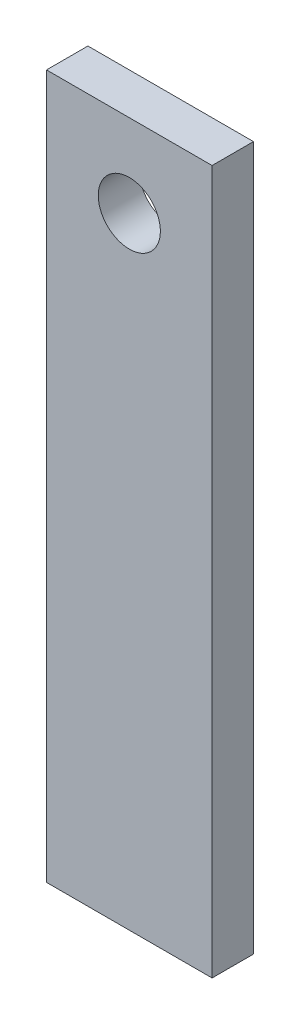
ISO-10303-21;
HEADER;
FILE_DESCRIPTION(('STEP AP214'),'2;1');
FILE_NAME('part.step','',(''),(''),'','','');
FILE_SCHEMA(('AUTOMOTIVE_DESIGN { 1 0 10303 214 1 1 1 1 }'));
ENDSEC;
DATA;
#1=APPLICATION_CONTEXT('core data for automotive mechanical design processes');
#2=APPLICATION_PROTOCOL_DEFINITION('international standard','automotive_design',2000,#1);
#3=PRODUCT_CONTEXT('',#1,'mechanical');
#4=PRODUCT('Part','Part','',(#3));
#5=PRODUCT_RELATED_PRODUCT_CATEGORY('part','',(#4));
#6=PRODUCT_DEFINITION_FORMATION('','',#4);
#7=PRODUCT_DEFINITION_CONTEXT('part definition',#1,'design');
#8=PRODUCT_DEFINITION('design','',#6,#7);
#9=PRODUCT_DEFINITION_SHAPE('','',#8);
#10=(LENGTH_UNIT() NAMED_UNIT(*) SI_UNIT(.MILLI.,.METRE.));
#11=(NAMED_UNIT(*) PLANE_ANGLE_UNIT() SI_UNIT($,.RADIAN.));
#12=(NAMED_UNIT(*) SI_UNIT($,.STERADIAN.) SOLID_ANGLE_UNIT());
#13=UNCERTAINTY_MEASURE_WITH_UNIT(LENGTH_MEASURE(1.E-05),#10,'distance_accuracy_value','');
#14=(GEOMETRIC_REPRESENTATION_CONTEXT(3) GLOBAL_UNCERTAINTY_ASSIGNED_CONTEXT((#13)) GLOBAL_UNIT_ASSIGNED_CONTEXT((#10,
#11,#12)) REPRESENTATION_CONTEXT('',''));
#15=CARTESIAN_POINT('',(0.,0.,0.));
#16=DIRECTION('',(0.,0.,1.));
#17=DIRECTION('',(1.,0.,0.));
#18=AXIS2_PLACEMENT_3D('',#15,#16,#17);
#19=CARTESIAN_POINT('',(0.,0.,9.525));
#20=DIRECTION('',(0.,0.,1.));
#21=DIRECTION('',(1.,0.,0.));
#22=AXIS2_PLACEMENT_3D('',#19,#20,#21);
#23=PLANE('',#22);
#24=DIRECTION('',(0.,-1.,0.));
#25=VECTOR('',#24,1.);
#26=CARTESIAN_POINT('',(-38.1,38.1,9.525));
#27=LINE('',#26,#25);
#28=CARTESIAN_POINT('',(-38.1,38.1,9.525));
#29=VERTEX_POINT('',#28);
#30=CARTESIAN_POINT('',(-38.1,-285.75,9.525));
#31=VERTEX_POINT('',#30);
#32=EDGE_CURVE('E94',#29,#31,#27,.T.);
#33=ORIENTED_EDGE('',*,*,#32,.T.);
#34=DIRECTION('',(1.,0.,0.));
#35=VECTOR('',#34,1.);
#36=CARTESIAN_POINT('',(-38.1,-285.75,9.525));
#37=LINE('',#36,#35);
#38=CARTESIAN_POINT('',(38.1,-285.75,9.525));
#39=VERTEX_POINT('',#38);
#40=EDGE_CURVE('E89',#31,#39,#37,.T.);
#41=ORIENTED_EDGE('',*,*,#40,.T.);
#42=DIRECTION('',(0.,1.,0.));
#43=VECTOR('',#42,1.);
#44=CARTESIAN_POINT('',(38.1,38.1,9.525));
#45=LINE('',#44,#43);
#46=CARTESIAN_POINT('',(38.1,38.1,9.525));
#47=VERTEX_POINT('',#46);
#48=EDGE_CURVE('E92',#39,#47,#45,.T.);
#49=ORIENTED_EDGE('',*,*,#48,.T.);
#50=DIRECTION('',(-1.,0.,0.));
#51=VECTOR('',#50,1.);
#52=CARTESIAN_POINT('',(-38.1,38.1,9.525));
#53=LINE('',#52,#51);
#54=EDGE_CURVE('E59',#47,#29,#53,.T.);
#55=ORIENTED_EDGE('',*,*,#54,.T.);
#56=EDGE_LOOP('',(#33,#41,#49,#55));
#57=FACE_BOUND('',#56,.T.);
#58=CARTESIAN_POINT('',(0.,0.,9.525));
#59=DIRECTION('',(0.,0.,1.));
#60=DIRECTION('',(1.,0.,0.));
#61=AXIS2_PLACEMENT_3D('',#58,#59,#60);
#62=CIRCLE('',#61,14.2875);
#63=CARTESIAN_POINT('',(-14.2875,0.,9.525));
#64=VERTEX_POINT('',#63);
#65=EDGE_CURVE('E109',#64,#64,#62,.T.);
#66=ORIENTED_EDGE('',*,*,#65,.F.);
#67=EDGE_LOOP('',(#66));
#68=FACE_BOUND('',#67,.T.);
#69=ADVANCED_FACE('F42',(#57,#68),#23,.T.);
#70=CARTESIAN_POINT('',(0.,0.,-9.525));
#71=DIRECTION('',(0.,0.,1.));
#72=DIRECTION('',(1.,0.,0.));
#73=AXIS2_PLACEMENT_3D('',#70,#71,#72);
#74=PLANE('',#73);
#75=DIRECTION('',(0.,-1.,0.));
#76=VECTOR('',#75,1.);
#77=CARTESIAN_POINT('',(-38.1,38.1,-9.525));
#78=LINE('',#77,#76);
#79=CARTESIAN_POINT('',(-38.1,38.1,-9.525));
#80=VERTEX_POINT('',#79);
#81=CARTESIAN_POINT('',(-38.1,-285.75,-9.525));
#82=VERTEX_POINT('',#81);
#83=EDGE_CURVE('E106',#80,#82,#78,.T.);
#84=ORIENTED_EDGE('',*,*,#83,.F.);
#85=DIRECTION('',(-1.,0.,0.));
#86=VECTOR('',#85,1.);
#87=CARTESIAN_POINT('',(-38.1,38.1,-9.525));
#88=LINE('',#87,#86);
#89=CARTESIAN_POINT('',(38.1,38.1,-9.525));
#90=VERTEX_POINT('',#89);
#91=EDGE_CURVE('E82',#90,#80,#88,.T.);
#92=ORIENTED_EDGE('',*,*,#91,.F.);
#93=DIRECTION('',(0.,1.,0.));
#94=VECTOR('',#93,1.);
#95=CARTESIAN_POINT('',(38.1,38.1,-9.525));
#96=LINE('',#95,#94);
#97=CARTESIAN_POINT('',(38.1,-285.75,-9.525));
#98=VERTEX_POINT('',#97);
#99=EDGE_CURVE('E76',#98,#90,#96,.T.);
#100=ORIENTED_EDGE('',*,*,#99,.F.);
#101=DIRECTION('',(1.,0.,0.));
#102=VECTOR('',#101,1.);
#103=CARTESIAN_POINT('',(-38.1,-285.75,-9.525));
#104=LINE('',#103,#102);
#105=EDGE_CURVE('E98',#82,#98,#104,.T.);
#106=ORIENTED_EDGE('',*,*,#105,.F.);
#107=EDGE_LOOP('',(#84,#92,#100,#106));
#108=FACE_BOUND('',#107,.T.);
#109=CARTESIAN_POINT('',(0.,0.,-9.525));
#110=DIRECTION('',(0.,0.,1.));
#111=DIRECTION('',(1.,0.,0.));
#112=AXIS2_PLACEMENT_3D('',#109,#110,#111);
#113=CIRCLE('',#112,14.2875);
#114=CARTESIAN_POINT('',(-14.2875,0.,-9.525));
#115=VERTEX_POINT('',#114);
#116=EDGE_CURVE('E121',#115,#115,#113,.T.);
#117=ORIENTED_EDGE('',*,*,#116,.T.);
#118=EDGE_LOOP('',(#117));
#119=FACE_BOUND('',#118,.T.);
#120=ADVANCED_FACE('F117',(#108,#119),#74,.F.);
#121=CARTESIAN_POINT('',(-38.1,38.1,9.525));
#122=DIRECTION('',(1.,0.,0.));
#123=DIRECTION('',(0.,1.,0.));
#124=AXIS2_PLACEMENT_3D('',#121,#122,#123);
#125=PLANE('',#124);
#126=ORIENTED_EDGE('',*,*,#83,.T.);
#127=DIRECTION('',(0.,0.,-1.));
#128=VECTOR('',#127,1.);
#129=CARTESIAN_POINT('',(-38.1,-285.75,9.525));
#130=LINE('',#129,#128);
#131=EDGE_CURVE('E13',#31,#82,#130,.T.);
#132=ORIENTED_EDGE('',*,*,#131,.F.);
#133=ORIENTED_EDGE('',*,*,#32,.F.);
#134=DIRECTION('',(0.,0.,-1.));
#135=VECTOR('',#134,1.);
#136=CARTESIAN_POINT('',(-38.1,38.1,9.525));
#137=LINE('',#136,#135);
#138=EDGE_CURVE('E102',#29,#80,#137,.T.);
#139=ORIENTED_EDGE('',*,*,#138,.T.);
#140=EDGE_LOOP('',(#126,#132,#133,#139));
#141=FACE_BOUND('',#140,.T.);
#142=ADVANCED_FACE('F44',(#141),#125,.F.);
#143=CARTESIAN_POINT('',(-38.1,-285.75,9.525));
#144=DIRECTION('',(0.,1.,0.));
#145=DIRECTION('',(-1.,0.,0.));
#146=AXIS2_PLACEMENT_3D('',#143,#144,#145);
#147=PLANE('',#146);
#148=ORIENTED_EDGE('',*,*,#105,.T.);
#149=DIRECTION('',(0.,0.,-1.));
#150=VECTOR('',#149,1.);
#151=CARTESIAN_POINT('',(38.1,-285.75,9.525));
#152=LINE('',#151,#150);
#153=EDGE_CURVE('E51',#39,#98,#152,.T.);
#154=ORIENTED_EDGE('',*,*,#153,.F.);
#155=ORIENTED_EDGE('',*,*,#40,.F.);
#156=ORIENTED_EDGE('',*,*,#131,.T.);
#157=EDGE_LOOP('',(#148,#154,#155,#156));
#158=FACE_BOUND('',#157,.T.);
#159=ADVANCED_FACE('F97',(#158),#147,.F.);
#160=CARTESIAN_POINT('',(38.1,38.1,9.525));
#161=DIRECTION('',(-1.,0.,0.));
#162=DIRECTION('',(0.,-1.,0.));
#163=AXIS2_PLACEMENT_3D('',#160,#161,#162);
#164=PLANE('',#163);
#165=ORIENTED_EDGE('',*,*,#99,.T.);
#166=DIRECTION('',(0.,0.,-1.));
#167=VECTOR('',#166,1.);
#168=CARTESIAN_POINT('',(38.1,38.1,9.525));
#169=LINE('',#168,#167);
#170=EDGE_CURVE('E99',#47,#90,#169,.T.);
#171=ORIENTED_EDGE('',*,*,#170,.F.);
#172=ORIENTED_EDGE('',*,*,#48,.F.);
#173=ORIENTED_EDGE('',*,*,#153,.T.);
#174=EDGE_LOOP('',(#165,#171,#172,#173));
#175=FACE_BOUND('',#174,.T.);
#176=ADVANCED_FACE('F100',(#175),#164,.F.);
#177=CARTESIAN_POINT('',(-38.1,38.1,9.525));
#178=DIRECTION('',(0.,-1.,0.));
#179=DIRECTION('',(0.,0.,-1.));
#180=AXIS2_PLACEMENT_3D('',#177,#178,#179);
#181=PLANE('',#180);
#182=ORIENTED_EDGE('',*,*,#91,.T.);
#183=ORIENTED_EDGE('',*,*,#138,.F.);
#184=ORIENTED_EDGE('',*,*,#54,.F.);
#185=ORIENTED_EDGE('',*,*,#170,.T.);
#186=EDGE_LOOP('',(#182,#183,#184,#185));
#187=FACE_BOUND('',#186,.T.);
#188=ADVANCED_FACE('F114',(#187),#181,.F.);
#189=CARTESIAN_POINT('',(0.,0.,9.525));
#190=DIRECTION('',(0.,0.,-1.));
#191=DIRECTION('',(-1.,0.,0.));
#192=AXIS2_PLACEMENT_3D('',#189,#190,#191);
#193=CYLINDRICAL_SURFACE('',#192,14.2875);
#194=CARTESIAN_POINT('',(-14.2875,0.,9.525));
#195=CARTESIAN_POINT('',(-14.2875,0.,9.3265625));
#196=CARTESIAN_POINT('',(-14.2875,0.,9.128125));
#197=CARTESIAN_POINT('',(-14.2875,0.,8.73125));
#198=CARTESIAN_POINT('',(-14.2875,0.,8.5328125));
#199=CARTESIAN_POINT('',(-14.2875,0.,8.1359375));
#200=CARTESIAN_POINT('',(-14.2875,0.,7.9375));
#201=CARTESIAN_POINT('',(-14.2875,0.,7.540625));
#202=CARTESIAN_POINT('',(-14.2875,0.,7.3421875));
#203=CARTESIAN_POINT('',(-14.2875,0.,6.9453125));
#204=CARTESIAN_POINT('',(-14.2875,0.,6.746875));
#205=CARTESIAN_POINT('',(-14.2875,0.,6.35));
#206=CARTESIAN_POINT('',(-14.2875,0.,6.1515625));
#207=CARTESIAN_POINT('',(-14.2875,0.,5.7546875));
#208=CARTESIAN_POINT('',(-14.2875,0.,5.55625));
#209=CARTESIAN_POINT('',(-14.2875,0.,5.159375));
#210=CARTESIAN_POINT('',(-14.2875,0.,4.9609375));
#211=CARTESIAN_POINT('',(-14.2875,0.,4.5640625));
#212=CARTESIAN_POINT('',(-14.2875,0.,4.365625));
#213=CARTESIAN_POINT('',(-14.2875,0.,3.96875));
#214=CARTESIAN_POINT('',(-14.2875,0.,3.7703125));
#215=CARTESIAN_POINT('',(-14.2875,0.,3.3734375));
#216=CARTESIAN_POINT('',(-14.2875,0.,3.175));
#217=CARTESIAN_POINT('',(-14.2875,0.,2.778125));
#218=CARTESIAN_POINT('',(-14.2875,0.,2.5796875));
#219=CARTESIAN_POINT('',(-14.2875,0.,2.1828125));
#220=CARTESIAN_POINT('',(-14.2875,0.,1.984375));
#221=CARTESIAN_POINT('',(-14.2875,0.,1.5875));
#222=CARTESIAN_POINT('',(-14.2875,0.,1.3890625));
#223=CARTESIAN_POINT('',(-14.2875,0.,0.992187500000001));
#224=CARTESIAN_POINT('',(-14.2875,0.,0.793750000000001));
#225=CARTESIAN_POINT('',(-14.2875,0.,0.396875));
#226=CARTESIAN_POINT('',(-14.2875,0.,0.1984375));
#227=CARTESIAN_POINT('',(-14.2875,0.,-0.1984375));
#228=CARTESIAN_POINT('',(-14.2875,0.,-0.396875));
#229=CARTESIAN_POINT('',(-14.2875,0.,-0.793750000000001));
#230=CARTESIAN_POINT('',(-14.2875,0.,-0.992187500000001));
#231=CARTESIAN_POINT('',(-14.2875,0.,-1.3890625));
#232=CARTESIAN_POINT('',(-14.2875,0.,-1.5875));
#233=CARTESIAN_POINT('',(-14.2875,0.,-1.984375));
#234=CARTESIAN_POINT('',(-14.2875,0.,-2.1828125));
#235=CARTESIAN_POINT('',(-14.2875,0.,-2.5796875));
#236=CARTESIAN_POINT('',(-14.2875,0.,-2.778125));
#237=CARTESIAN_POINT('',(-14.2875,0.,-3.175));
#238=CARTESIAN_POINT('',(-14.2875,0.,-3.3734375));
#239=CARTESIAN_POINT('',(-14.2875,0.,-3.7703125));
#240=CARTESIAN_POINT('',(-14.2875,0.,-3.96875));
#241=CARTESIAN_POINT('',(-14.2875,0.,-4.365625));
#242=CARTESIAN_POINT('',(-14.2875,0.,-4.5640625));
#243=CARTESIAN_POINT('',(-14.2875,0.,-4.9609375));
#244=CARTESIAN_POINT('',(-14.2875,0.,-5.159375));
#245=CARTESIAN_POINT('',(-14.2875,0.,-5.55625));
#246=CARTESIAN_POINT('',(-14.2875,0.,-5.7546875));
#247=CARTESIAN_POINT('',(-14.2875,0.,-6.1515625));
#248=CARTESIAN_POINT('',(-14.2875,0.,-6.35));
#249=CARTESIAN_POINT('',(-14.2875,0.,-6.746875));
#250=CARTESIAN_POINT('',(-14.2875,0.,-6.9453125));
#251=CARTESIAN_POINT('',(-14.2875,0.,-7.3421875));
#252=CARTESIAN_POINT('',(-14.2875,0.,-7.540625));
#253=CARTESIAN_POINT('',(-14.2875,0.,-7.9375));
#254=CARTESIAN_POINT('',(-14.2875,0.,-8.1359375));
#255=CARTESIAN_POINT('',(-14.2875,0.,-8.5328125));
#256=CARTESIAN_POINT('',(-14.2875,0.,-8.73125));
#257=CARTESIAN_POINT('',(-14.2875,0.,-9.128125));
#258=CARTESIAN_POINT('',(-14.2875,0.,-9.3265625));
#259=CARTESIAN_POINT('',(-14.2875,0.,-9.525));
#260=B_SPLINE_CURVE_WITH_KNOTS('',3,(#194,#195,#196,#197,#198,#199,#200,#201,#202,#203,#204,
#205,#206,#207,#208,#209,#210,#211,#212,#213,#214,#215,#216,#217,#218,#219,#220,#221,#222,#223,
#224,#225,#226,#227,#228,#229,#230,#231,#232,#233,#234,#235,#236,#237,#238,#239,#240,#241,#242,
#243,#244,#245,#246,#247,#248,#249,#250,#251,#252,#253,#254,#255,#256,#257,#258,#259),
.UNSPECIFIED.,.F.,.F.,(4,2,2,2,2,2,2,2,2,2,2,2,2,2,2,2,2,2,2,2,2,2,2,2,2,2,2,2,2,2,2,2,4),(0.,
0.5953125,1.190625,1.7859375,2.38125,2.9765625,3.571875,4.1671875,4.7625,5.3578125,5.953125,
6.5484375,7.14375,7.7390625,8.334375,8.9296875,9.525,10.1203125,10.715625,11.3109375,11.90625,
12.5015625,13.096875,13.6921875,14.2875,14.8828125,15.478125,16.0734375,16.66875,17.2640625,
17.859375,18.4546875,19.05),.UNSPECIFIED.);
#261=EDGE_CURVE('BSEAM127',#64,#115,#260,.T.);
#262=ORIENTED_EDGE('',*,*,#65,.T.);
#263=ORIENTED_EDGE('',*,*,#116,.F.);
#264=ORIENTED_EDGE('',*,*,#261,.T.);
#265=ORIENTED_EDGE('',*,*,#261,.F.);
#266=EDGE_LOOP('',(#262,#264,#263,#265));
#267=FACE_BOUND('',#266,.T.);
#268=ADVANCED_FACE('F127',(#267),#193,.F.);
#269=CLOSED_SHELL('',(#69,#120,#142,#159,#176,#188,#268));
#270=MANIFOLD_SOLID_BREP('B2',#269);
#271=ADVANCED_BREP_SHAPE_REPRESENTATION('',(#18,#270),#14);
#272=SHAPE_DEFINITION_REPRESENTATION(#9,#271);
ENDSEC;
END-ISO-10303-21;
